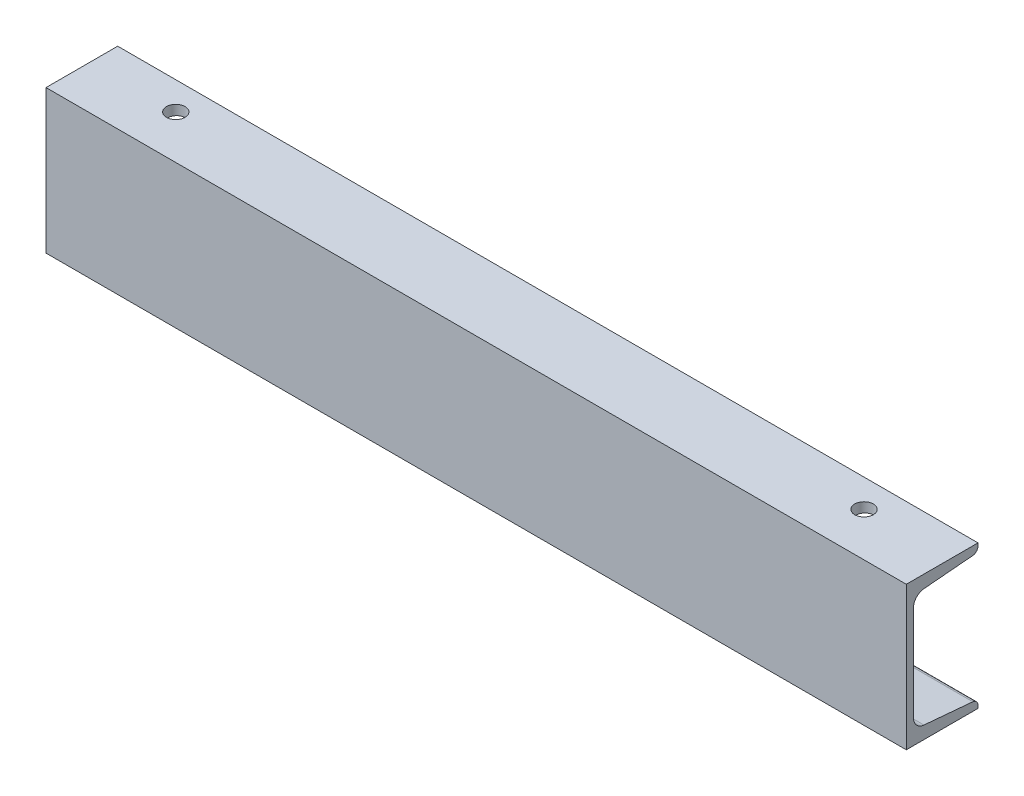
ISO-10303-21;
HEADER;
FILE_DESCRIPTION(('STEP AP214'),'2;1');
FILE_NAME('part.step','',(''),(''),'','','');
FILE_SCHEMA(('AUTOMOTIVE_DESIGN { 1 0 10303 214 1 1 1 1 }'));
ENDSEC;
DATA;
#1=APPLICATION_CONTEXT('core data for automotive mechanical design processes');
#2=APPLICATION_PROTOCOL_DEFINITION('international standard','automotive_design',2000,#1);
#3=PRODUCT_CONTEXT('',#1,'mechanical');
#4=PRODUCT('Part','Part','',(#3));
#5=PRODUCT_RELATED_PRODUCT_CATEGORY('part','',(#4));
#6=PRODUCT_DEFINITION_FORMATION('','',#4);
#7=PRODUCT_DEFINITION_CONTEXT('part definition',#1,'design');
#8=PRODUCT_DEFINITION('design','',#6,#7);
#9=PRODUCT_DEFINITION_SHAPE('','',#8);
#10=(LENGTH_UNIT() NAMED_UNIT(*) SI_UNIT(.MILLI.,.METRE.));
#11=(NAMED_UNIT(*) PLANE_ANGLE_UNIT() SI_UNIT($,.RADIAN.));
#12=(NAMED_UNIT(*) SI_UNIT($,.STERADIAN.) SOLID_ANGLE_UNIT());
#13=UNCERTAINTY_MEASURE_WITH_UNIT(LENGTH_MEASURE(1.E-05),#10,'distance_accuracy_value','');
#14=(GEOMETRIC_REPRESENTATION_CONTEXT(3) GLOBAL_UNCERTAINTY_ASSIGNED_CONTEXT((#13)) GLOBAL_UNIT_ASSIGNED_CONTEXT((#10,
#11,#12)) REPRESENTATION_CONTEXT('',''));
#15=CARTESIAN_POINT('',(0.,0.,0.));
#16=DIRECTION('',(0.,0.,1.));
#17=DIRECTION('',(1.,0.,0.));
#18=AXIS2_PLACEMENT_3D('',#15,#16,#17);
#19=CARTESIAN_POINT('',(600.,0.,0.));
#20=DIRECTION('',(0.,1.,0.));
#21=DIRECTION('',(0.,0.,1.));
#22=AXIS2_PLACEMENT_3D('',#19,#20,#21);
#23=PLANE('',#22);
#24=DIRECTION('',(0.,0.,-1.));
#25=VECTOR('',#24,1.);
#26=CARTESIAN_POINT('',(0.,0.,0.));
#27=LINE('',#26,#25);
#28=CARTESIAN_POINT('',(0.,0.,0.));
#29=VERTEX_POINT('',#28);
#30=CARTESIAN_POINT('',(0.,0.,-50.));
#31=VERTEX_POINT('',#30);
#32=EDGE_CURVE('E152',#29,#31,#27,.T.);
#33=ORIENTED_EDGE('',*,*,#32,.T.);
#34=DIRECTION('',(-1.,0.,0.));
#35=VECTOR('',#34,1.);
#36=CARTESIAN_POINT('',(600.,0.,-50.));
#37=LINE('',#36,#35);
#38=CARTESIAN_POINT('',(600.,0.,-50.));
#39=VERTEX_POINT('',#38);
#40=EDGE_CURVE('E11',#39,#31,#37,.T.);
#41=ORIENTED_EDGE('',*,*,#40,.F.);
#42=DIRECTION('',(0.,0.,-1.));
#43=VECTOR('',#42,1.);
#44=CARTESIAN_POINT('',(600.,0.,0.));
#45=LINE('',#44,#43);
#46=CARTESIAN_POINT('',(600.,0.,0.));
#47=VERTEX_POINT('',#46);
#48=EDGE_CURVE('E175',#47,#39,#45,.T.);
#49=ORIENTED_EDGE('',*,*,#48,.F.);
#50=DIRECTION('',(-1.,0.,0.));
#51=VECTOR('',#50,1.);
#52=CARTESIAN_POINT('',(600.,0.,0.));
#53=LINE('',#52,#51);
#54=EDGE_CURVE('E148',#47,#29,#53,.T.);
#55=ORIENTED_EDGE('',*,*,#54,.T.);
#56=EDGE_LOOP('',(#33,#41,#49,#55));
#57=FACE_BOUND('',#56,.T.);
#58=ADVANCED_FACE('F32',(#57),#23,.F.);
#59=CARTESIAN_POINT('',(600.,0.,-50.));
#60=DIRECTION('',(0.,0.,1.));
#61=DIRECTION('',(1.,0.,0.));
#62=AXIS2_PLACEMENT_3D('',#59,#60,#61);
#63=PLANE('',#62);
#64=DIRECTION('',(0.,1.,0.));
#65=VECTOR('',#64,1.);
#66=CARTESIAN_POINT('',(0.,0.,-50.));
#67=LINE('',#66,#65);
#68=CARTESIAN_POINT('',(0.,1.86618037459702,-50.));
#69=VERTEX_POINT('',#68);
#70=EDGE_CURVE('E155',#31,#69,#67,.T.);
#71=ORIENTED_EDGE('',*,*,#70,.T.);
#72=DIRECTION('',(-1.,0.,0.));
#73=VECTOR('',#72,1.);
#74=CARTESIAN_POINT('',(600.,1.86618037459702,-50.));
#75=LINE('',#74,#73);
#76=CARTESIAN_POINT('',(600.,1.86618037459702,-50.));
#77=VERTEX_POINT('',#76);
#78=EDGE_CURVE('E40',#77,#69,#75,.T.);
#79=ORIENTED_EDGE('',*,*,#78,.F.);
#80=DIRECTION('',(0.,1.,0.));
#81=VECTOR('',#80,1.);
#82=CARTESIAN_POINT('',(600.,0.,-50.));
#83=LINE('',#82,#81);
#84=EDGE_CURVE('E103',#39,#77,#83,.T.);
#85=ORIENTED_EDGE('',*,*,#84,.F.);
#86=ORIENTED_EDGE('',*,*,#40,.T.);
#87=EDGE_LOOP('',(#71,#79,#85,#86));
#88=FACE_BOUND('',#87,.T.);
#89=ADVANCED_FACE('F254',(#88),#63,.F.);
#90=CARTESIAN_POINT('',(600.,1.86618037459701,-46.));
#91=DIRECTION('',(-1.,0.,0.));
#92=DIRECTION('',(0.,0.,1.));
#93=AXIS2_PLACEMENT_3D('',#90,#91,#92);
#94=CYLINDRICAL_SURFACE('',#93,4.);
#95=CARTESIAN_POINT('',(0.,1.86618037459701,-46.));
#96=DIRECTION('',(1.,0.,0.));
#97=DIRECTION('',(0.,0.,-1.));
#98=AXIS2_PLACEMENT_3D('',#95,#96,#97);
#99=CIRCLE('',#98,4.);
#100=CARTESIAN_POINT('',(0.,5.850959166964,-46.3486229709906));
#101=VERTEX_POINT('',#100);
#102=EDGE_CURVE('E158',#69,#101,#99,.T.);
#103=ORIENTED_EDGE('',*,*,#102,.T.);
#104=DIRECTION('',(-1.,0.,0.));
#105=VECTOR('',#104,1.);
#106=CARTESIAN_POINT('',(600.,5.850959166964,-46.3486229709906));
#107=LINE('',#106,#105);
#108=CARTESIAN_POINT('',(600.,5.850959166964,-46.3486229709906));
#109=VERTEX_POINT('',#108);
#110=EDGE_CURVE('E194',#109,#101,#107,.T.);
#111=ORIENTED_EDGE('',*,*,#110,.F.);
#112=CARTESIAN_POINT('',(600.,1.86618037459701,-46.));
#113=DIRECTION('',(1.,0.,0.));
#114=DIRECTION('',(0.,0.,-1.));
#115=AXIS2_PLACEMENT_3D('',#112,#113,#114);
#116=CIRCLE('',#115,4.);
#117=EDGE_CURVE('E202',#77,#109,#116,.T.);
#118=ORIENTED_EDGE('',*,*,#117,.F.);
#119=ORIENTED_EDGE('',*,*,#78,.T.);
#120=EDGE_LOOP('',(#103,#111,#118,#119));
#121=FACE_BOUND('',#120,.T.);
#122=ADVANCED_FACE('F200',(#121),#94,.T.);
#123=CARTESIAN_POINT('',(600.,8.82958673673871,-12.3027540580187));
#124=DIRECTION('',(0.,-0.996194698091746,0.0871557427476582));
#125=DIRECTION('',(0.,-0.0871557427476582,-0.996194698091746));
#126=AXIS2_PLACEMENT_3D('',#123,#124,#125);
#127=PLANE('',#126);
#128=DIRECTION('',(0.,0.0871557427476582,0.996194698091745));
#129=VECTOR('',#128,1.);
#130=CARTESIAN_POINT('',(0.,8.82958673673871,-12.3027540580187));
#131=LINE('',#130,#129);
#132=CARTESIAN_POINT('',(0.,8.82958673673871,-12.3027540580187));
#133=VERTEX_POINT('',#132);
#134=EDGE_CURVE('E160',#101,#133,#131,.T.);
#135=ORIENTED_EDGE('',*,*,#134,.T.);
#136=DIRECTION('',(-1.,0.,0.));
#137=VECTOR('',#136,1.);
#138=CARTESIAN_POINT('',(600.,8.82958673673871,-12.3027540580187));
#139=LINE('',#138,#137);
#140=CARTESIAN_POINT('',(600.,8.82958673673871,-12.3027540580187));
#141=VERTEX_POINT('',#140);
#142=EDGE_CURVE('E191',#141,#133,#139,.T.);
#143=ORIENTED_EDGE('',*,*,#142,.F.);
#144=DIRECTION('',(0.,0.0871557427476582,0.996194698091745));
#145=VECTOR('',#144,1.);
#146=CARTESIAN_POINT('',(600.,8.82958673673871,-12.3027540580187));
#147=LINE('',#146,#145);
#148=EDGE_CURVE('E220',#109,#141,#147,.T.);
#149=ORIENTED_EDGE('',*,*,#148,.F.);
#150=ORIENTED_EDGE('',*,*,#110,.T.);
#151=EDGE_LOOP('',(#135,#143,#149,#150));
#152=FACE_BOUND('',#151,.T.);
#153=ADVANCED_FACE('F211',(#152),#127,.F.);
#154=CARTESIAN_POINT('',(600.,16.7991443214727,-13.));
#155=DIRECTION('',(-1.,0.,0.));
#156=DIRECTION('',(0.,0.,1.));
#157=AXIS2_PLACEMENT_3D('',#154,#155,#156);
#158=CYLINDRICAL_SURFACE('',#157,8.);
#159=CARTESIAN_POINT('',(0.,16.7991443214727,-13.));
#160=DIRECTION('',(-1.,0.,0.));
#161=DIRECTION('',(0.,0.,-1.));
#162=AXIS2_PLACEMENT_3D('',#159,#160,#161);
#163=CIRCLE('',#162,8.);
#164=CARTESIAN_POINT('',(0.,16.7991443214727,-5.));
#165=VERTEX_POINT('',#164);
#166=EDGE_CURVE('E162',#133,#165,#163,.T.);
#167=ORIENTED_EDGE('',*,*,#166,.T.);
#168=DIRECTION('',(-1.,0.,0.));
#169=VECTOR('',#168,1.);
#170=CARTESIAN_POINT('',(600.,16.7991443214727,-5.));
#171=LINE('',#170,#169);
#172=CARTESIAN_POINT('',(600.,16.7991443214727,-5.));
#173=VERTEX_POINT('',#172);
#174=EDGE_CURVE('E188',#173,#165,#171,.T.);
#175=ORIENTED_EDGE('',*,*,#174,.F.);
#176=CARTESIAN_POINT('',(600.,16.7991443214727,-13.));
#177=DIRECTION('',(-1.,0.,0.));
#178=DIRECTION('',(0.,0.,-1.));
#179=AXIS2_PLACEMENT_3D('',#176,#177,#178);
#180=CIRCLE('',#179,8.);
#181=EDGE_CURVE('E217',#141,#173,#180,.T.);
#182=ORIENTED_EDGE('',*,*,#181,.F.);
#183=ORIENTED_EDGE('',*,*,#142,.T.);
#184=EDGE_LOOP('',(#167,#175,#182,#183));
#185=FACE_BOUND('',#184,.T.);
#186=ADVANCED_FACE('F215',(#185),#158,.F.);
#187=CARTESIAN_POINT('',(600.,83.2008556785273,-4.99999999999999));
#188=DIRECTION('',(0.,0.,1.));
#189=DIRECTION('',(0.,-1.,0.));
#190=AXIS2_PLACEMENT_3D('',#187,#188,#189);
#191=PLANE('',#190);
#192=DIRECTION('',(0.,1.,0.));
#193=VECTOR('',#192,1.);
#194=CARTESIAN_POINT('',(0.,83.2008556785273,-4.99999999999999));
#195=LINE('',#194,#193);
#196=CARTESIAN_POINT('',(0.,83.2008556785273,-5.));
#197=VERTEX_POINT('',#196);
#198=EDGE_CURVE('E164',#165,#197,#195,.T.);
#199=ORIENTED_EDGE('',*,*,#198,.T.);
#200=DIRECTION('',(-1.,0.,0.));
#201=VECTOR('',#200,1.);
#202=CARTESIAN_POINT('',(600.,83.2008556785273,-5.));
#203=LINE('',#202,#201);
#204=CARTESIAN_POINT('',(600.,83.2008556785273,-5.));
#205=VERTEX_POINT('',#204);
#206=EDGE_CURVE('E185',#205,#197,#203,.T.);
#207=ORIENTED_EDGE('',*,*,#206,.F.);
#208=DIRECTION('',(0.,1.,0.));
#209=VECTOR('',#208,1.);
#210=CARTESIAN_POINT('',(600.,83.2008556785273,-4.99999999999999));
#211=LINE('',#210,#209);
#212=EDGE_CURVE('E219',#173,#205,#211,.T.);
#213=ORIENTED_EDGE('',*,*,#212,.F.);
#214=ORIENTED_EDGE('',*,*,#174,.T.);
#215=EDGE_LOOP('',(#199,#207,#213,#214));
#216=FACE_BOUND('',#215,.T.);
#217=ADVANCED_FACE('F267',(#216),#191,.F.);
#218=CARTESIAN_POINT('',(600.,83.2008556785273,-13.));
#219=DIRECTION('',(-1.,0.,0.));
#220=DIRECTION('',(0.,0.,1.));
#221=AXIS2_PLACEMENT_3D('',#218,#219,#220);
#222=CYLINDRICAL_SURFACE('',#221,8.);
#223=CARTESIAN_POINT('',(0.,83.2008556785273,-13.));
#224=DIRECTION('',(-1.,0.,0.));
#225=DIRECTION('',(0.,0.,1.));
#226=AXIS2_PLACEMENT_3D('',#223,#224,#225);
#227=CIRCLE('',#226,8.);
#228=CARTESIAN_POINT('',(0.,91.1704132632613,-12.3027540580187));
#229=VERTEX_POINT('',#228);
#230=EDGE_CURVE('E166',#197,#229,#227,.T.);
#231=ORIENTED_EDGE('',*,*,#230,.T.);
#232=DIRECTION('',(-1.,0.,0.));
#233=VECTOR('',#232,1.);
#234=CARTESIAN_POINT('',(600.,91.1704132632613,-12.3027540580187));
#235=LINE('',#234,#233);
#236=CARTESIAN_POINT('',(600.,91.1704132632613,-12.3027540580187));
#237=VERTEX_POINT('',#236);
#238=EDGE_CURVE('E182',#237,#229,#235,.T.);
#239=ORIENTED_EDGE('',*,*,#238,.F.);
#240=CARTESIAN_POINT('',(600.,83.2008556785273,-13.));
#241=DIRECTION('',(-1.,0.,0.));
#242=DIRECTION('',(0.,0.,1.));
#243=AXIS2_PLACEMENT_3D('',#240,#241,#242);
#244=CIRCLE('',#243,8.);
#245=EDGE_CURVE('E222',#205,#237,#244,.T.);
#246=ORIENTED_EDGE('',*,*,#245,.F.);
#247=ORIENTED_EDGE('',*,*,#206,.T.);
#248=EDGE_LOOP('',(#231,#239,#246,#247));
#249=FACE_BOUND('',#248,.T.);
#250=ADVANCED_FACE('F270',(#249),#222,.F.);
#251=CARTESIAN_POINT('',(600.,91.1704132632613,-12.3027540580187));
#252=DIRECTION('',(0.,0.996194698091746,0.0871557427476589));
#253=DIRECTION('',(0.,-0.0871557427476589,0.996194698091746));
#254=AXIS2_PLACEMENT_3D('',#251,#252,#253);
#255=PLANE('',#254);
#256=CARTESIAN_POINT('',(60.0000000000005,92.7624659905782,-30.5000000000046));
#257=DIRECTION('',(0.,0.996194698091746,0.0871557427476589));
#258=DIRECTION('',(0.,0.0871557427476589,-0.996194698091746));
#259=AXIS2_PLACEMENT_3D('',#256,#257,#258);
#260=ELLIPSE('',#259,6.52482894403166,6.4999999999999);
#261=CARTESIAN_POINT('',(60.0000000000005,93.3311423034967,-37.0000000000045));
#262=VERTEX_POINT('',#261);
#263=EDGE_CURVE('E339',#262,#262,#260,.T.);
#264=ORIENTED_EDGE('',*,*,#263,.T.);
#265=EDGE_LOOP('',(#264));
#266=FACE_BOUND('',#265,.T.);
#267=CARTESIAN_POINT('',(539.999999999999,92.7624659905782,-30.5000000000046));
#268=DIRECTION('',(0.,0.996194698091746,0.0871557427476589));
#269=DIRECTION('',(0.,0.0871557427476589,-0.996194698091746));
#270=AXIS2_PLACEMENT_3D('',#267,#268,#269);
#271=ELLIPSE('',#270,6.52482894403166,6.4999999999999);
#272=CARTESIAN_POINT('',(539.999999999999,93.3311423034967,-37.0000000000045));
#273=VERTEX_POINT('',#272);
#274=EDGE_CURVE('E156',#273,#273,#271,.T.);
#275=ORIENTED_EDGE('',*,*,#274,.T.);
#276=EDGE_LOOP('',(#275));
#277=FACE_BOUND('',#276,.T.);
#278=DIRECTION('',(0.,0.0871557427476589,-0.996194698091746));
#279=VECTOR('',#278,1.);
#280=CARTESIAN_POINT('',(0.,91.1704132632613,-12.3027540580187));
#281=LINE('',#280,#279);
#282=CARTESIAN_POINT('',(0.,94.149040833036,-46.3486229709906));
#283=VERTEX_POINT('',#282);
#284=EDGE_CURVE('E168',#229,#283,#281,.T.);
#285=ORIENTED_EDGE('',*,*,#284,.T.);
#286=DIRECTION('',(-1.,0.,0.));
#287=VECTOR('',#286,1.);
#288=CARTESIAN_POINT('',(600.,94.149040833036,-46.3486229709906));
#289=LINE('',#288,#287);
#290=CARTESIAN_POINT('',(600.,94.149040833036,-46.3486229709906));
#291=VERTEX_POINT('',#290);
#292=EDGE_CURVE('E179',#291,#283,#289,.T.);
#293=ORIENTED_EDGE('',*,*,#292,.F.);
#294=DIRECTION('',(0.,0.0871557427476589,-0.996194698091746));
#295=VECTOR('',#294,1.);
#296=CARTESIAN_POINT('',(600.,91.1704132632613,-12.3027540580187));
#297=LINE('',#296,#295);
#298=EDGE_CURVE('E228',#237,#291,#297,.T.);
#299=ORIENTED_EDGE('',*,*,#298,.F.);
#300=ORIENTED_EDGE('',*,*,#238,.T.);
#301=EDGE_LOOP('',(#285,#293,#299,#300));
#302=FACE_BOUND('',#301,.T.);
#303=ADVANCED_FACE('F234',(#266,#277,#302),#255,.F.);
#304=CARTESIAN_POINT('',(600.,98.133819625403,-46.));
#305=DIRECTION('',(-1.,0.,0.));
#306=DIRECTION('',(0.,0.,1.));
#307=AXIS2_PLACEMENT_3D('',#304,#305,#306);
#308=CYLINDRICAL_SURFACE('',#307,4.);
#309=CARTESIAN_POINT('',(0.,98.133819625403,-46.));
#310=DIRECTION('',(1.,0.,0.));
#311=DIRECTION('',(0.,0.,1.));
#312=AXIS2_PLACEMENT_3D('',#309,#310,#311);
#313=CIRCLE('',#312,4.);
#314=CARTESIAN_POINT('',(0.,98.133819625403,-50.));
#315=VERTEX_POINT('',#314);
#316=EDGE_CURVE('E170',#283,#315,#313,.T.);
#317=ORIENTED_EDGE('',*,*,#316,.T.);
#318=DIRECTION('',(-1.,0.,0.));
#319=VECTOR('',#318,1.);
#320=CARTESIAN_POINT('',(600.,98.133819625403,-50.));
#321=LINE('',#320,#319);
#322=CARTESIAN_POINT('',(600.,98.133819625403,-50.));
#323=VERTEX_POINT('',#322);
#324=EDGE_CURVE('E143',#323,#315,#321,.T.);
#325=ORIENTED_EDGE('',*,*,#324,.F.);
#326=CARTESIAN_POINT('',(600.,98.133819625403,-46.));
#327=DIRECTION('',(1.,0.,0.));
#328=DIRECTION('',(0.,0.,1.));
#329=AXIS2_PLACEMENT_3D('',#326,#327,#328);
#330=CIRCLE('',#329,4.);
#331=EDGE_CURVE('E134',#291,#323,#330,.T.);
#332=ORIENTED_EDGE('',*,*,#331,.F.);
#333=ORIENTED_EDGE('',*,*,#292,.T.);
#334=EDGE_LOOP('',(#317,#325,#332,#333));
#335=FACE_BOUND('',#334,.T.);
#336=ADVANCED_FACE('F238',(#335),#308,.T.);
#337=CARTESIAN_POINT('',(600.,100.,-50.));
#338=DIRECTION('',(0.,0.,1.));
#339=DIRECTION('',(0.,-1.,0.));
#340=AXIS2_PLACEMENT_3D('',#337,#338,#339);
#341=PLANE('',#340);
#342=DIRECTION('',(0.,1.,0.));
#343=VECTOR('',#342,1.);
#344=CARTESIAN_POINT('',(0.,100.,-50.));
#345=LINE('',#344,#343);
#346=CARTESIAN_POINT('',(0.,100.,-50.));
#347=VERTEX_POINT('',#346);
#348=EDGE_CURVE('E142',#315,#347,#345,.T.);
#349=ORIENTED_EDGE('',*,*,#348,.T.);
#350=DIRECTION('',(-1.,0.,0.));
#351=VECTOR('',#350,1.);
#352=CARTESIAN_POINT('',(600.,100.,-50.));
#353=LINE('',#352,#351);
#354=CARTESIAN_POINT('',(600.,100.,-50.));
#355=VERTEX_POINT('',#354);
#356=EDGE_CURVE('E139',#355,#347,#353,.T.);
#357=ORIENTED_EDGE('',*,*,#356,.F.);
#358=DIRECTION('',(0.,1.,0.));
#359=VECTOR('',#358,1.);
#360=CARTESIAN_POINT('',(600.,100.,-50.));
#361=LINE('',#360,#359);
#362=EDGE_CURVE('E128',#323,#355,#361,.T.);
#363=ORIENTED_EDGE('',*,*,#362,.F.);
#364=ORIENTED_EDGE('',*,*,#324,.T.);
#365=EDGE_LOOP('',(#349,#357,#363,#364));
#366=FACE_BOUND('',#365,.T.);
#367=ADVANCED_FACE('F140',(#366),#341,.F.);
#368=CARTESIAN_POINT('',(600.,100.,0.));
#369=DIRECTION('',(0.,-1.,0.));
#370=DIRECTION('',(0.,0.,-1.));
#371=AXIS2_PLACEMENT_3D('',#368,#369,#370);
#372=PLANE('',#371);
#373=CARTESIAN_POINT('',(60.0000000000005,100.,-30.5000000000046));
#374=DIRECTION('',(0.,1.,0.));
#375=DIRECTION('',(0.,0.,-1.));
#376=AXIS2_PLACEMENT_3D('',#373,#374,#375);
#377=CIRCLE('',#376,6.4999999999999);
#378=CARTESIAN_POINT('',(60.0000000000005,100.,-37.0000000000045));
#379=VERTEX_POINT('',#378);
#380=EDGE_CURVE('E336',#379,#379,#377,.T.);
#381=ORIENTED_EDGE('',*,*,#380,.F.);
#382=EDGE_LOOP('',(#381));
#383=FACE_BOUND('',#382,.T.);
#384=CARTESIAN_POINT('',(539.999999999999,100.,-30.5000000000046));
#385=DIRECTION('',(0.,1.,0.));
#386=DIRECTION('',(0.,0.,1.));
#387=AXIS2_PLACEMENT_3D('',#384,#385,#386);
#388=CIRCLE('',#387,6.4999999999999);
#389=CARTESIAN_POINT('',(539.999999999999,100.,-24.0000000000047));
#390=VERTEX_POINT('',#389);
#391=EDGE_CURVE('E340',#390,#390,#388,.T.);
#392=ORIENTED_EDGE('',*,*,#391,.F.);
#393=EDGE_LOOP('',(#392));
#394=FACE_BOUND('',#393,.T.);
#395=DIRECTION('',(0.,0.,1.));
#396=VECTOR('',#395,1.);
#397=CARTESIAN_POINT('',(0.,100.,0.));
#398=LINE('',#397,#396);
#399=CARTESIAN_POINT('',(0.,100.,0.));
#400=VERTEX_POINT('',#399);
#401=EDGE_CURVE('E89',#347,#400,#398,.T.);
#402=ORIENTED_EDGE('',*,*,#401,.T.);
#403=DIRECTION('',(-1.,0.,0.));
#404=VECTOR('',#403,1.);
#405=CARTESIAN_POINT('',(600.,100.,0.));
#406=LINE('',#405,#404);
#407=CARTESIAN_POINT('',(600.,100.,0.));
#408=VERTEX_POINT('',#407);
#409=EDGE_CURVE('E144',#408,#400,#406,.T.);
#410=ORIENTED_EDGE('',*,*,#409,.F.);
#411=DIRECTION('',(0.,0.,1.));
#412=VECTOR('',#411,1.);
#413=CARTESIAN_POINT('',(600.,100.,0.));
#414=LINE('',#413,#412);
#415=EDGE_CURVE('E132',#355,#408,#414,.T.);
#416=ORIENTED_EDGE('',*,*,#415,.F.);
#417=ORIENTED_EDGE('',*,*,#356,.T.);
#418=EDGE_LOOP('',(#402,#410,#416,#417));
#419=FACE_BOUND('',#418,.T.);
#420=ADVANCED_FACE('F146',(#383,#394,#419),#372,.F.);
#421=CARTESIAN_POINT('',(600.,0.,0.));
#422=DIRECTION('',(0.,0.,-1.));
#423=DIRECTION('',(0.,1.,0.));
#424=AXIS2_PLACEMENT_3D('',#421,#422,#423);
#425=PLANE('',#424);
#426=DIRECTION('',(0.,-1.,0.));
#427=VECTOR('',#426,1.);
#428=CARTESIAN_POINT('',(0.,0.,0.));
#429=LINE('',#428,#427);
#430=EDGE_CURVE('E95',#400,#29,#429,.T.);
#431=ORIENTED_EDGE('',*,*,#430,.T.);
#432=ORIENTED_EDGE('',*,*,#54,.F.);
#433=DIRECTION('',(0.,-1.,0.));
#434=VECTOR('',#433,1.);
#435=CARTESIAN_POINT('',(600.,0.,0.));
#436=LINE('',#435,#434);
#437=EDGE_CURVE('E48',#408,#47,#436,.T.);
#438=ORIENTED_EDGE('',*,*,#437,.F.);
#439=ORIENTED_EDGE('',*,*,#409,.T.);
#440=EDGE_LOOP('',(#431,#432,#438,#439));
#441=FACE_BOUND('',#440,.T.);
#442=ADVANCED_FACE('F242',(#441),#425,.F.);
#443=CARTESIAN_POINT('',(600.,1.86618037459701,-46.));
#444=DIRECTION('',(1.,0.,0.));
#445=DIRECTION('',(0.,0.,-1.));
#446=AXIS2_PLACEMENT_3D('',#443,#444,#445);
#447=PLANE('',#446);
#448=ORIENTED_EDGE('',*,*,#48,.T.);
#449=ORIENTED_EDGE('',*,*,#84,.T.);
#450=ORIENTED_EDGE('',*,*,#117,.T.);
#451=ORIENTED_EDGE('',*,*,#148,.T.);
#452=ORIENTED_EDGE('',*,*,#181,.T.);
#453=ORIENTED_EDGE('',*,*,#212,.T.);
#454=ORIENTED_EDGE('',*,*,#245,.T.);
#455=ORIENTED_EDGE('',*,*,#298,.T.);
#456=ORIENTED_EDGE('',*,*,#331,.T.);
#457=ORIENTED_EDGE('',*,*,#362,.T.);
#458=ORIENTED_EDGE('',*,*,#415,.T.);
#459=ORIENTED_EDGE('',*,*,#437,.T.);
#460=EDGE_LOOP('',(#448,#449,#450,#451,#452,#453,#454,#455,#456,#457,#458,#459));
#461=FACE_BOUND('',#460,.T.);
#462=ADVANCED_FACE('F130',(#461),#447,.T.);
#463=CARTESIAN_POINT('',(0.,1.86618037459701,-46.));
#464=DIRECTION('',(1.,0.,0.));
#465=DIRECTION('',(0.,0.,-1.));
#466=AXIS2_PLACEMENT_3D('',#463,#464,#465);
#467=PLANE('',#466);
#468=ORIENTED_EDGE('',*,*,#32,.F.);
#469=ORIENTED_EDGE('',*,*,#430,.F.);
#470=ORIENTED_EDGE('',*,*,#401,.F.);
#471=ORIENTED_EDGE('',*,*,#348,.F.);
#472=ORIENTED_EDGE('',*,*,#316,.F.);
#473=ORIENTED_EDGE('',*,*,#284,.F.);
#474=ORIENTED_EDGE('',*,*,#230,.F.);
#475=ORIENTED_EDGE('',*,*,#198,.F.);
#476=ORIENTED_EDGE('',*,*,#166,.F.);
#477=ORIENTED_EDGE('',*,*,#134,.F.);
#478=ORIENTED_EDGE('',*,*,#102,.F.);
#479=ORIENTED_EDGE('',*,*,#70,.F.);
#480=EDGE_LOOP('',(#468,#469,#470,#471,#472,#473,#474,#475,#476,#477,#478,#479));
#481=FACE_BOUND('',#480,.T.);
#482=ADVANCED_FACE('F206',(#481),#467,.F.);
#483=CARTESIAN_POINT('',(539.999999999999,90.,-30.5000000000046));
#484=DIRECTION('',(0.,1.,0.));
#485=DIRECTION('',(0.,0.,1.));
#486=AXIS2_PLACEMENT_3D('',#483,#484,#485);
#487=CYLINDRICAL_SURFACE('',#486,6.4999999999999);
#488=ORIENTED_EDGE('',*,*,#391,.T.);
#489=EDGE_LOOP('',(#488));
#490=FACE_BOUND('',#489,.T.);
#491=ORIENTED_EDGE('',*,*,#274,.F.);
#492=EDGE_LOOP('',(#491));
#493=FACE_BOUND('',#492,.T.);
#494=ADVANCED_FACE('F299',(#490,#493),#487,.F.);
#495=CARTESIAN_POINT('',(60.0000000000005,90.,-30.5000000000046));
#496=DIRECTION('',(0.,1.,0.));
#497=DIRECTION('',(0.,0.,1.));
#498=AXIS2_PLACEMENT_3D('',#495,#496,#497);
#499=CYLINDRICAL_SURFACE('',#498,6.4999999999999);
#500=ORIENTED_EDGE('',*,*,#380,.T.);
#501=EDGE_LOOP('',(#500));
#502=FACE_BOUND('',#501,.T.);
#503=ORIENTED_EDGE('',*,*,#263,.F.);
#504=EDGE_LOOP('',(#503));
#505=FACE_BOUND('',#504,.T.);
#506=ADVANCED_FACE('F304',(#502,#505),#499,.F.);
#507=CLOSED_SHELL('',(#58,#89,#122,#153,#186,#217,#250,#303,#336,#367,#420,#442,#462,#482,#494,#506));
#508=MANIFOLD_SOLID_BREP('B2',#507);
#509=ADVANCED_BREP_SHAPE_REPRESENTATION('',(#18,#508),#14);
#510=SHAPE_DEFINITION_REPRESENTATION(#9,#509);
ENDSEC;
END-ISO-10303-21;
